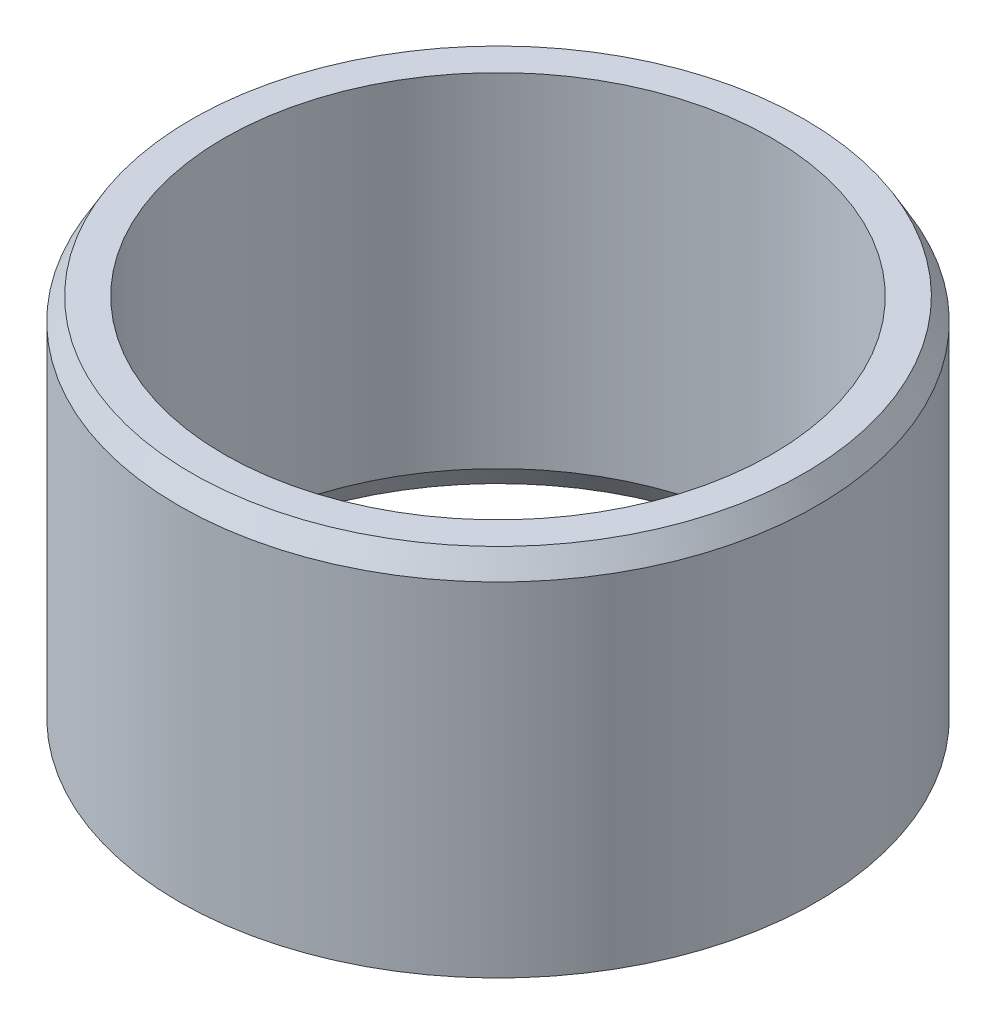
ISO-10303-21;
HEADER;
FILE_DESCRIPTION(('STEP AP214'),'2;1');
FILE_NAME('part.step','',(''),(''),'','','');
FILE_SCHEMA(('AUTOMOTIVE_DESIGN { 1 0 10303 214 1 1 1 1 }'));
ENDSEC;
DATA;
#1=APPLICATION_CONTEXT('core data for automotive mechanical design processes');
#2=APPLICATION_PROTOCOL_DEFINITION('international standard','automotive_design',2000,#1);
#3=PRODUCT_CONTEXT('',#1,'mechanical');
#4=PRODUCT('Part','Part','',(#3));
#5=PRODUCT_RELATED_PRODUCT_CATEGORY('part','',(#4));
#6=PRODUCT_DEFINITION_FORMATION('','',#4);
#7=PRODUCT_DEFINITION_CONTEXT('part definition',#1,'design');
#8=PRODUCT_DEFINITION('design','',#6,#7);
#9=PRODUCT_DEFINITION_SHAPE('','',#8);
#10=(LENGTH_UNIT() NAMED_UNIT(*) SI_UNIT(.MILLI.,.METRE.));
#11=(NAMED_UNIT(*) PLANE_ANGLE_UNIT() SI_UNIT($,.RADIAN.));
#12=(NAMED_UNIT(*) SI_UNIT($,.STERADIAN.) SOLID_ANGLE_UNIT());
#13=UNCERTAINTY_MEASURE_WITH_UNIT(LENGTH_MEASURE(1.E-05),#10,'distance_accuracy_value','');
#14=(GEOMETRIC_REPRESENTATION_CONTEXT(3) GLOBAL_UNCERTAINTY_ASSIGNED_CONTEXT((#13)) GLOBAL_UNIT_ASSIGNED_CONTEXT((#10,
#11,#12)) REPRESENTATION_CONTEXT('',''));
#15=CARTESIAN_POINT('',(0.,0.,0.));
#16=DIRECTION('',(0.,0.,1.));
#17=DIRECTION('',(1.,0.,0.));
#18=AXIS2_PLACEMENT_3D('',#15,#16,#17);
#19=CARTESIAN_POINT('',(0.,0.762,0.));
#20=DIRECTION('',(0.,-1.,0.));
#21=DIRECTION('',(0.,0.,-1.));
#22=AXIS2_PLACEMENT_3D('',#19,#20,#21);
#23=CONICAL_SURFACE('',#22,9.53389,0.523598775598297);
#24=CARTESIAN_POINT('',(0.,0.,0.));
#25=DIRECTION('',(0.,-1.,0.));
#26=DIRECTION('',(0.,0.,-1.));
#27=AXIS2_PLACEMENT_3D('',#24,#25,#26);
#28=CIRCLE('',#27,9.97383090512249);
#29=CARTESIAN_POINT('',(0.,0.,-9.97383090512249));
#30=VERTEX_POINT('',#29);
#31=EDGE_CURVE('E10',#30,#30,#28,.T.);
#32=ORIENTED_EDGE('',*,*,#31,.T.);
#33=EDGE_LOOP('',(#32));
#34=FACE_BOUND('',#33,.T.);
#35=CARTESIAN_POINT('',(0.,0.762,0.));
#36=DIRECTION('',(0.,-1.,0.));
#37=DIRECTION('',(0.,0.,-1.));
#38=AXIS2_PLACEMENT_3D('',#35,#36,#37);
#39=CIRCLE('',#38,9.53389);
#40=CARTESIAN_POINT('',(0.,0.762,-9.53389));
#41=VERTEX_POINT('',#40);
#42=EDGE_CURVE('E59',#41,#41,#39,.T.);
#43=ORIENTED_EDGE('',*,*,#42,.F.);
#44=EDGE_LOOP('',(#43));
#45=FACE_BOUND('',#44,.T.);
#46=ADVANCED_FACE('F30',(#34,#45),#23,.F.);
#47=CARTESIAN_POINT('',(9.97383090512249,0.,0.));
#48=DIRECTION('',(0.,-1.,0.));
#49=DIRECTION('',(0.,0.,-1.));
#50=AXIS2_PLACEMENT_3D('',#47,#48,#49);
#51=PLANE('',#50);
#52=CARTESIAN_POINT('',(0.,0.,0.));
#53=DIRECTION('',(0.,-1.,0.));
#54=DIRECTION('',(0.,0.,-1.));
#55=AXIS2_PLACEMENT_3D('',#52,#53,#54);
#56=CIRCLE('',#55,11.10869);
#57=CARTESIAN_POINT('',(0.,0.,-11.10869));
#58=VERTEX_POINT('',#57);
#59=EDGE_CURVE('E37',#58,#58,#56,.T.);
#60=ORIENTED_EDGE('',*,*,#59,.T.);
#61=EDGE_LOOP('',(#60));
#62=FACE_BOUND('',#61,.T.);
#63=ORIENTED_EDGE('',*,*,#31,.F.);
#64=EDGE_LOOP('',(#63));
#65=FACE_BOUND('',#64,.T.);
#66=ADVANCED_FACE('F68',(#62,#65),#51,.T.);
#67=CARTESIAN_POINT('',(0.,-4.4876757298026,0.));
#68=DIRECTION('',(0.,-1.,0.));
#69=DIRECTION('',(0.,0.,-1.));
#70=AXIS2_PLACEMENT_3D('',#67,#68,#69);
#71=CYLINDRICAL_SURFACE('',#70,11.10869);
#72=CARTESIAN_POINT('',(0.,11.938,0.));
#73=DIRECTION('',(0.,-1.,0.));
#74=DIRECTION('',(0.,0.,-1.));
#75=AXIS2_PLACEMENT_3D('',#72,#73,#74);
#76=CIRCLE('',#75,11.10869);
#77=CARTESIAN_POINT('',(0.,11.938,-11.10869));
#78=VERTEX_POINT('',#77);
#79=EDGE_CURVE('E45',#78,#78,#76,.T.);
#80=ORIENTED_EDGE('',*,*,#79,.T.);
#81=EDGE_LOOP('',(#80));
#82=FACE_BOUND('',#81,.T.);
#83=ORIENTED_EDGE('',*,*,#59,.F.);
#84=EDGE_LOOP('',(#83));
#85=FACE_BOUND('',#84,.T.);
#86=ADVANCED_FACE('F72',(#82,#85),#71,.T.);
#87=CARTESIAN_POINT('',(0.,11.938,0.));
#88=DIRECTION('',(0.,-1.,0.));
#89=DIRECTION('',(0.,0.,-1.));
#90=AXIS2_PLACEMENT_3D('',#87,#88,#89);
#91=CONICAL_SURFACE('',#90,11.10869,0.523598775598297);
#92=CARTESIAN_POINT('',(0.,12.7,0.));
#93=DIRECTION('',(0.,-1.,0.));
#94=DIRECTION('',(0.,0.,-1.));
#95=AXIS2_PLACEMENT_3D('',#92,#93,#94);
#96=CIRCLE('',#95,10.6687490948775);
#97=CARTESIAN_POINT('',(0.,12.7,-10.6687490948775));
#98=VERTEX_POINT('',#97);
#99=EDGE_CURVE('E50',#98,#98,#96,.T.);
#100=ORIENTED_EDGE('',*,*,#99,.T.);
#101=EDGE_LOOP('',(#100));
#102=FACE_BOUND('',#101,.T.);
#103=ORIENTED_EDGE('',*,*,#79,.F.);
#104=EDGE_LOOP('',(#103));
#105=FACE_BOUND('',#104,.T.);
#106=ADVANCED_FACE('F76',(#102,#105),#91,.T.);
#107=CARTESIAN_POINT('',(10.6687490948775,12.7,0.));
#108=DIRECTION('',(0.,1.,0.));
#109=DIRECTION('',(0.,0.,1.));
#110=AXIS2_PLACEMENT_3D('',#107,#108,#109);
#111=PLANE('',#110);
#112=CARTESIAN_POINT('',(0.,12.7,0.));
#113=DIRECTION('',(0.,-1.,0.));
#114=DIRECTION('',(0.,0.,-1.));
#115=AXIS2_PLACEMENT_3D('',#112,#113,#114);
#116=CIRCLE('',#115,9.53389);
#117=CARTESIAN_POINT('',(0.,12.7,-9.53389));
#118=VERTEX_POINT('',#117);
#119=EDGE_CURVE('E56',#118,#118,#116,.T.);
#120=ORIENTED_EDGE('',*,*,#119,.T.);
#121=EDGE_LOOP('',(#120));
#122=FACE_BOUND('',#121,.T.);
#123=ORIENTED_EDGE('',*,*,#99,.F.);
#124=EDGE_LOOP('',(#123));
#125=FACE_BOUND('',#124,.T.);
#126=ADVANCED_FACE('F83',(#122,#125),#111,.T.);
#127=CARTESIAN_POINT('',(0.,-4.4876757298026,0.));
#128=DIRECTION('',(0.,-1.,0.));
#129=DIRECTION('',(0.,0.,-1.));
#130=AXIS2_PLACEMENT_3D('',#127,#128,#129);
#131=CYLINDRICAL_SURFACE('',#130,9.53389);
#132=ORIENTED_EDGE('',*,*,#42,.T.);
#133=EDGE_LOOP('',(#132));
#134=FACE_BOUND('',#133,.T.);
#135=ORIENTED_EDGE('',*,*,#119,.F.);
#136=EDGE_LOOP('',(#135));
#137=FACE_BOUND('',#136,.T.);
#138=ADVANCED_FACE('F64',(#134,#137),#131,.F.);
#139=CLOSED_SHELL('',(#46,#66,#86,#106,#126,#138));
#140=MANIFOLD_SOLID_BREP('B2',#139);
#141=ADVANCED_BREP_SHAPE_REPRESENTATION('',(#18,#140),#14);
#142=SHAPE_DEFINITION_REPRESENTATION(#9,#141);
ENDSEC;
END-ISO-10303-21;
